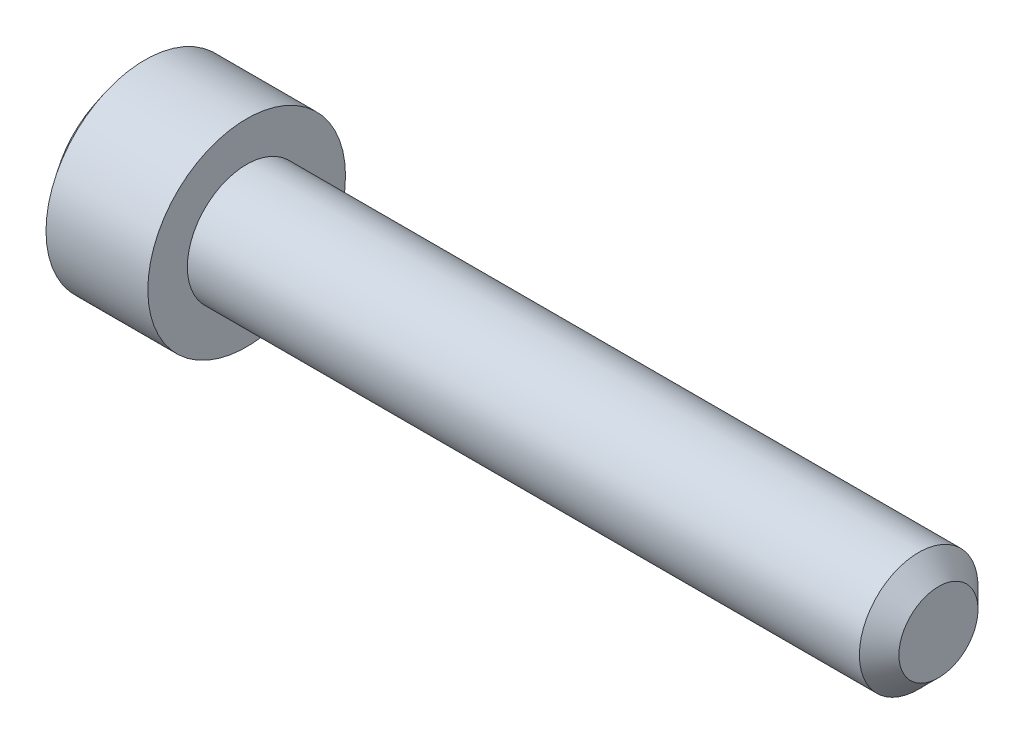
ISO-10303-21;
HEADER;
FILE_DESCRIPTION(('STEP AP214'),'2;1');
FILE_NAME('part.step','',(''),(''),'','','');
FILE_SCHEMA(('AUTOMOTIVE_DESIGN { 1 0 10303 214 1 1 1 1 }'));
ENDSEC;
DATA;
#1=APPLICATION_CONTEXT('core data for automotive mechanical design processes');
#2=APPLICATION_PROTOCOL_DEFINITION('international standard','automotive_design',2000,#1);
#3=PRODUCT_CONTEXT('',#1,'mechanical');
#4=PRODUCT('Part','Part','',(#3));
#5=PRODUCT_RELATED_PRODUCT_CATEGORY('part','',(#4));
#6=PRODUCT_DEFINITION_FORMATION('','',#4);
#7=PRODUCT_DEFINITION_CONTEXT('part definition',#1,'design');
#8=PRODUCT_DEFINITION('design','',#6,#7);
#9=PRODUCT_DEFINITION_SHAPE('','',#8);
#10=(LENGTH_UNIT() NAMED_UNIT(*) SI_UNIT(.MILLI.,.METRE.));
#11=(NAMED_UNIT(*) PLANE_ANGLE_UNIT() SI_UNIT($,.RADIAN.));
#12=(NAMED_UNIT(*) SI_UNIT($,.STERADIAN.) SOLID_ANGLE_UNIT());
#13=UNCERTAINTY_MEASURE_WITH_UNIT(LENGTH_MEASURE(1.E-05),#10,'distance_accuracy_value','');
#14=(GEOMETRIC_REPRESENTATION_CONTEXT(3) GLOBAL_UNCERTAINTY_ASSIGNED_CONTEXT((#13)) GLOBAL_UNIT_ASSIGNED_CONTEXT((#10,
#11,#12)) REPRESENTATION_CONTEXT('',''));
#15=CARTESIAN_POINT('',(0.,0.,0.));
#16=DIRECTION('',(0.,0.,1.));
#17=DIRECTION('',(1.,0.,0.));
#18=AXIS2_PLACEMENT_3D('',#15,#16,#17);
#19=CARTESIAN_POINT('',(0.,0.,0.));
#20=DIRECTION('',(-1.,0.,0.));
#21=DIRECTION('',(0.,0.,1.));
#22=AXIS2_PLACEMENT_3D('',#19,#20,#21);
#23=PLANE('',#22);
#24=CARTESIAN_POINT('',(0.,0.,0.));
#25=DIRECTION('',(-1.,0.,0.));
#26=DIRECTION('',(0.,0.,1.));
#27=AXIS2_PLACEMENT_3D('',#24,#25,#26);
#28=CIRCLE('',#27,3.86862915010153);
#29=CARTESIAN_POINT('',(0.,0.,3.86862915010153));
#30=VERTEX_POINT('',#29);
#31=EDGE_CURVE('E11',#30,#30,#28,.T.);
#32=ORIENTED_EDGE('',*,*,#31,.T.);
#33=EDGE_LOOP('',(#32));
#34=FACE_BOUND('',#33,.T.);
#35=DIRECTION('',(0.,0.909373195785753,-0.415981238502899));
#36=VECTOR('',#35,1.);
#37=CARTESIAN_POINT('',(0.,-2.19361678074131,-1.89600279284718));
#38=LINE('',#37,#36);
#39=CARTESIAN_POINT('',(0.,-2.19361678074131,-1.89600279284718));
#40=VERTEX_POINT('',#39);
#41=CARTESIAN_POINT('',(0.,0.,-2.89944497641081));
#42=VERTEX_POINT('',#41);
#43=EDGE_CURVE('E104',#40,#42,#38,.T.);
#44=ORIENTED_EDGE('',*,*,#43,.T.);
#45=DIRECTION('',(0.,0.862233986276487,0.506510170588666));
#46=VECTOR('',#45,1.);
#47=CARTESIAN_POINT('',(0.,0.,-2.89944497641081));
#48=LINE('',#47,#46);
#49=CARTESIAN_POINT('',(0.,2.5325508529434,-1.41172495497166));
#50=VERTEX_POINT('',#49);
#51=EDGE_CURVE('E45',#42,#50,#48,.T.);
#52=ORIENTED_EDGE('',*,*,#51,.T.);
#53=DIRECTION('',(0.,-0.101933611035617,0.994791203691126));
#54=VECTOR('',#53,1.);
#55=CARTESIAN_POINT('',(0.,2.5325508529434,-1.41172495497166));
#56=LINE('',#55,#54);
#57=CARTESIAN_POINT('',(0.,2.19361678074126,1.89600279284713));
#58=VERTEX_POINT('',#57);
#59=EDGE_CURVE('E85',#50,#58,#56,.T.);
#60=ORIENTED_EDGE('',*,*,#59,.T.);
#61=DIRECTION('',(0.,-0.909373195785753,0.415981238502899));
#62=VECTOR('',#61,1.);
#63=CARTESIAN_POINT('',(0.,2.19361678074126,1.89600279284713));
#64=LINE('',#63,#62);
#65=CARTESIAN_POINT('',(0.,0.,2.89944497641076));
#66=VERTEX_POINT('',#65);
#67=EDGE_CURVE('E93',#58,#66,#64,.T.);
#68=ORIENTED_EDGE('',*,*,#67,.T.);
#69=DIRECTION('',(0.,-0.862233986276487,-0.506510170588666));
#70=VECTOR('',#69,1.);
#71=CARTESIAN_POINT('',(0.,0.,2.89944497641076));
#72=LINE('',#71,#70);
#73=CARTESIAN_POINT('',(0.,-2.5325508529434,1.41172495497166));
#74=VERTEX_POINT('',#73);
#75=EDGE_CURVE('E108',#66,#74,#72,.T.);
#76=ORIENTED_EDGE('',*,*,#75,.T.);
#77=DIRECTION('',(0.,0.101933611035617,-0.994791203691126));
#78=VECTOR('',#77,1.);
#79=CARTESIAN_POINT('',(0.,-2.5325508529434,1.41172495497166));
#80=LINE('',#79,#78);
#81=EDGE_CURVE('E111',#74,#40,#80,.T.);
#82=ORIENTED_EDGE('',*,*,#81,.T.);
#83=EDGE_LOOP('',(#44,#52,#60,#68,#76,#82));
#84=FACE_BOUND('',#83,.T.);
#85=ADVANCED_FACE('F31',(#34,#84),#23,.T.);
#86=CARTESIAN_POINT('',(0.,0.,0.));
#87=DIRECTION('',(1.,0.,0.));
#88=DIRECTION('',(0.,0.,-1.));
#89=AXIS2_PLACEMENT_3D('',#86,#87,#88);
#90=CONICAL_SURFACE('',#89,3.86862915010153,0.927295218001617);
#91=CARTESIAN_POINT('',(0.848528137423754,0.,0.));
#92=DIRECTION('',(-1.,0.,0.));
#93=DIRECTION('',(0.,0.,1.));
#94=AXIS2_PLACEMENT_3D('',#91,#92,#93);
#95=CIRCLE('',#94,5.00000000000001);
#96=CARTESIAN_POINT('',(0.848528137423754,0.,5.00000000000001));
#97=VERTEX_POINT('',#96);
#98=EDGE_CURVE('E38',#97,#97,#95,.T.);
#99=ORIENTED_EDGE('',*,*,#98,.T.);
#100=EDGE_LOOP('',(#99));
#101=FACE_BOUND('',#100,.T.);
#102=ORIENTED_EDGE('',*,*,#31,.F.);
#103=EDGE_LOOP('',(#102));
#104=FACE_BOUND('',#103,.T.);
#105=ADVANCED_FACE('F146',(#101,#104),#90,.T.);
#106=CARTESIAN_POINT('',(-28.5761966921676,0.,0.));
#107=DIRECTION('',(-1.,0.,0.));
#108=DIRECTION('',(0.,0.,1.));
#109=AXIS2_PLACEMENT_3D('',#106,#107,#108);
#110=CYLINDRICAL_SURFACE('',#109,5.00000000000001);
#111=CARTESIAN_POINT('',(6.00000000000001,0.,0.));
#112=DIRECTION('',(-1.,0.,0.));
#113=DIRECTION('',(0.,0.,1.));
#114=AXIS2_PLACEMENT_3D('',#111,#112,#113);
#115=CIRCLE('',#114,5.00000000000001);
#116=CARTESIAN_POINT('',(6.00000000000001,0.,5.00000000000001));
#117=VERTEX_POINT('',#116);
#118=EDGE_CURVE('E141',#117,#117,#115,.T.);
#119=ORIENTED_EDGE('',*,*,#118,.T.);
#120=EDGE_LOOP('',(#119));
#121=FACE_BOUND('',#120,.T.);
#122=ORIENTED_EDGE('',*,*,#98,.F.);
#123=EDGE_LOOP('',(#122));
#124=FACE_BOUND('',#123,.T.);
#125=ADVANCED_FACE('F149',(#121,#124),#110,.T.);
#126=CARTESIAN_POINT('',(6.00000000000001,4.99999999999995,0.));
#127=DIRECTION('',(1.,0.,0.));
#128=DIRECTION('',(0.,0.,-1.));
#129=AXIS2_PLACEMENT_3D('',#126,#127,#128);
#130=PLANE('',#129);
#131=CARTESIAN_POINT('',(6.00000000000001,0.,0.));
#132=DIRECTION('',(-1.,0.,0.));
#133=DIRECTION('',(0.,0.,1.));
#134=AXIS2_PLACEMENT_3D('',#131,#132,#133);
#135=CIRCLE('',#134,2.99999999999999);
#136=CARTESIAN_POINT('',(6.00000000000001,0.,2.99999999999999));
#137=VERTEX_POINT('',#136);
#138=EDGE_CURVE('E138',#137,#137,#135,.T.);
#139=ORIENTED_EDGE('',*,*,#138,.T.);
#140=EDGE_LOOP('',(#139));
#141=FACE_BOUND('',#140,.T.);
#142=ORIENTED_EDGE('',*,*,#118,.F.);
#143=EDGE_LOOP('',(#142));
#144=FACE_BOUND('',#143,.T.);
#145=ADVANCED_FACE('F151',(#141,#144),#130,.T.);
#146=CARTESIAN_POINT('',(-28.5761966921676,0.,0.));
#147=DIRECTION('',(-1.,0.,0.));
#148=DIRECTION('',(0.,0.,1.));
#149=AXIS2_PLACEMENT_3D('',#146,#147,#148);
#150=CYLINDRICAL_SURFACE('',#149,2.99999999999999);
#151=CARTESIAN_POINT('',(40.,0.,0.));
#152=DIRECTION('',(-1.,0.,0.));
#153=DIRECTION('',(0.,0.,1.));
#154=AXIS2_PLACEMENT_3D('',#151,#152,#153);
#155=CIRCLE('',#154,2.99999999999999);
#156=CARTESIAN_POINT('',(40.,0.,2.99999999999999));
#157=VERTEX_POINT('',#156);
#158=EDGE_CURVE('E135',#157,#157,#155,.T.);
#159=ORIENTED_EDGE('',*,*,#158,.T.);
#160=EDGE_LOOP('',(#159));
#161=FACE_BOUND('',#160,.T.);
#162=ORIENTED_EDGE('',*,*,#138,.F.);
#163=EDGE_LOOP('',(#162));
#164=FACE_BOUND('',#163,.T.);
#165=ADVANCED_FACE('F158',(#161,#164),#150,.T.);
#166=CARTESIAN_POINT('',(40.,0.,0.));
#167=DIRECTION('',(-1.,0.,0.));
#168=DIRECTION('',(0.,0.,1.));
#169=AXIS2_PLACEMENT_3D('',#166,#167,#168);
#170=CONICAL_SURFACE('',#169,2.99999999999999,0.785398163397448);
#171=CARTESIAN_POINT('',(41.,0.,0.));
#172=DIRECTION('',(-1.,0.,0.));
#173=DIRECTION('',(0.,0.,1.));
#174=AXIS2_PLACEMENT_3D('',#171,#172,#173);
#175=CIRCLE('',#174,1.99999999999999);
#176=CARTESIAN_POINT('',(41.,0.,1.99999999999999));
#177=VERTEX_POINT('',#176);
#178=EDGE_CURVE('E99',#177,#177,#175,.T.);
#179=ORIENTED_EDGE('',*,*,#178,.T.);
#180=EDGE_LOOP('',(#179));
#181=FACE_BOUND('',#180,.T.);
#182=ORIENTED_EDGE('',*,*,#158,.F.);
#183=EDGE_LOOP('',(#182));
#184=FACE_BOUND('',#183,.T.);
#185=ADVANCED_FACE('F189',(#181,#184),#170,.T.);
#186=CARTESIAN_POINT('',(40.9999999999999,2.00000000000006,0.));
#187=DIRECTION('',(1.,0.,0.));
#188=DIRECTION('',(0.,0.,-1.));
#189=AXIS2_PLACEMENT_3D('',#186,#187,#188);
#190=PLANE('',#189);
#191=ORIENTED_EDGE('',*,*,#178,.F.);
#192=EDGE_LOOP('',(#191));
#193=FACE_BOUND('',#192,.T.);
#194=ADVANCED_FACE('F199',(#193),#190,.T.);
#195=CARTESIAN_POINT('',(3.00000000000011,0.,-2.89944497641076));
#196=DIRECTION('',(0.,-0.506510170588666,0.862233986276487));
#197=DIRECTION('',(0.,-0.862233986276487,-0.506510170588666));
#198=AXIS2_PLACEMENT_3D('',#195,#196,#197);
#199=PLANE('',#198);
#200=ORIENTED_EDGE('',*,*,#51,.F.);
#201=DIRECTION('',(-1.,0.,0.));
#202=VECTOR('',#201,1.);
#203=CARTESIAN_POINT('',(3.00000000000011,0.,-2.89944497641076));
#204=LINE('',#203,#202);
#205=CARTESIAN_POINT('',(3.00000000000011,0.,-2.89944497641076));
#206=VERTEX_POINT('',#205);
#207=EDGE_CURVE('E124',#206,#42,#204,.T.);
#208=ORIENTED_EDGE('',*,*,#207,.F.);
#209=DIRECTION('',(0.,0.862233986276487,0.506510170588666));
#210=VECTOR('',#209,1.);
#211=CARTESIAN_POINT('',(3.00000000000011,0.,-2.89944497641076));
#212=LINE('',#211,#210);
#213=CARTESIAN_POINT('',(3.,2.53255085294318,-1.41172495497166));
#214=VERTEX_POINT('',#213);
#215=EDGE_CURVE('E98',#206,#214,#212,.T.);
#216=ORIENTED_EDGE('',*,*,#215,.T.);
#217=DIRECTION('',(-1.,0.,0.));
#218=VECTOR('',#217,1.);
#219=CARTESIAN_POINT('',(3.,2.53255085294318,-1.41172495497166));
#220=LINE('',#219,#218);
#221=EDGE_CURVE('E87',#214,#50,#220,.T.);
#222=ORIENTED_EDGE('',*,*,#221,.T.);
#223=EDGE_LOOP('',(#200,#208,#216,#222));
#224=FACE_BOUND('',#223,.T.);
#225=ADVANCED_FACE('F96',(#224),#199,.T.);
#226=CARTESIAN_POINT('',(3.,2.53255085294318,-1.41172495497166));
#227=DIRECTION('',(0.,-0.994791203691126,-0.101933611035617));
#228=DIRECTION('',(0.,0.101933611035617,-0.994791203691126));
#229=AXIS2_PLACEMENT_3D('',#226,#227,#228);
#230=PLANE('',#229);
#231=ORIENTED_EDGE('',*,*,#59,.F.);
#232=ORIENTED_EDGE('',*,*,#221,.F.);
#233=DIRECTION('',(0.,-0.101933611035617,0.994791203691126));
#234=VECTOR('',#233,1.);
#235=CARTESIAN_POINT('',(3.,2.53255085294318,-1.41172495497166));
#236=LINE('',#235,#234);
#237=CARTESIAN_POINT('',(3.00000000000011,2.1936167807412,1.89600279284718));
#238=VERTEX_POINT('',#237);
#239=EDGE_CURVE('E115',#214,#238,#236,.T.);
#240=ORIENTED_EDGE('',*,*,#239,.T.);
#241=DIRECTION('',(-1.,0.,0.));
#242=VECTOR('',#241,1.);
#243=CARTESIAN_POINT('',(3.00000000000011,2.1936167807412,1.89600279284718));
#244=LINE('',#243,#242);
#245=EDGE_CURVE('E89',#238,#58,#244,.T.);
#246=ORIENTED_EDGE('',*,*,#245,.T.);
#247=EDGE_LOOP('',(#231,#232,#240,#246));
#248=FACE_BOUND('',#247,.T.);
#249=ADVANCED_FACE('F86',(#248),#230,.T.);
#250=CARTESIAN_POINT('',(3.00000000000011,2.1936167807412,1.89600279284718));
#251=DIRECTION('',(0.,-0.415981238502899,-0.909373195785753));
#252=DIRECTION('',(0.,0.909373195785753,-0.415981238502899));
#253=AXIS2_PLACEMENT_3D('',#250,#251,#252);
#254=PLANE('',#253);
#255=ORIENTED_EDGE('',*,*,#67,.F.);
#256=ORIENTED_EDGE('',*,*,#245,.F.);
#257=DIRECTION('',(0.,-0.909373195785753,0.415981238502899));
#258=VECTOR('',#257,1.);
#259=CARTESIAN_POINT('',(3.00000000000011,2.1936167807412,1.89600279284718));
#260=LINE('',#259,#258);
#261=CARTESIAN_POINT('',(3.,0.,2.89944497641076));
#262=VERTEX_POINT('',#261);
#263=EDGE_CURVE('E117',#238,#262,#260,.T.);
#264=ORIENTED_EDGE('',*,*,#263,.T.);
#265=DIRECTION('',(-1.,0.,0.));
#266=VECTOR('',#265,1.);
#267=CARTESIAN_POINT('',(3.,0.,2.89944497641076));
#268=LINE('',#267,#266);
#269=EDGE_CURVE('E130',#262,#66,#268,.T.);
#270=ORIENTED_EDGE('',*,*,#269,.T.);
#271=EDGE_LOOP('',(#255,#256,#264,#270));
#272=FACE_BOUND('',#271,.T.);
#273=ADVANCED_FACE('F226',(#272),#254,.T.);
#274=CARTESIAN_POINT('',(3.,0.,2.89944497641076));
#275=DIRECTION('',(0.,0.506510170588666,-0.862233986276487));
#276=DIRECTION('',(0.,0.862233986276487,0.506510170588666));
#277=AXIS2_PLACEMENT_3D('',#274,#275,#276);
#278=PLANE('',#277);
#279=ORIENTED_EDGE('',*,*,#75,.F.);
#280=ORIENTED_EDGE('',*,*,#269,.F.);
#281=DIRECTION('',(0.,-0.862233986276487,-0.506510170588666));
#282=VECTOR('',#281,1.);
#283=CARTESIAN_POINT('',(3.,0.,2.89944497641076));
#284=LINE('',#283,#282);
#285=CARTESIAN_POINT('',(3.,-2.5325508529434,1.41172495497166));
#286=VERTEX_POINT('',#285);
#287=EDGE_CURVE('E119',#262,#286,#284,.T.);
#288=ORIENTED_EDGE('',*,*,#287,.T.);
#289=DIRECTION('',(-1.,0.,0.));
#290=VECTOR('',#289,1.);
#291=CARTESIAN_POINT('',(3.,-2.5325508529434,1.41172495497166));
#292=LINE('',#291,#290);
#293=EDGE_CURVE('E128',#286,#74,#292,.T.);
#294=ORIENTED_EDGE('',*,*,#293,.T.);
#295=EDGE_LOOP('',(#279,#280,#288,#294));
#296=FACE_BOUND('',#295,.T.);
#297=ADVANCED_FACE('F235',(#296),#278,.T.);
#298=CARTESIAN_POINT('',(3.,-2.5325508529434,1.41172495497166));
#299=DIRECTION('',(0.,0.994791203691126,0.101933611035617));
#300=DIRECTION('',(0.,-0.101933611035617,0.994791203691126));
#301=AXIS2_PLACEMENT_3D('',#298,#299,#300);
#302=PLANE('',#301);
#303=ORIENTED_EDGE('',*,*,#81,.F.);
#304=ORIENTED_EDGE('',*,*,#293,.F.);
#305=DIRECTION('',(0.,0.101933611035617,-0.994791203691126));
#306=VECTOR('',#305,1.);
#307=CARTESIAN_POINT('',(3.,-2.5325508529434,1.41172495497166));
#308=LINE('',#307,#306);
#309=CARTESIAN_POINT('',(3.,-2.19361678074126,-1.89600279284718));
#310=VERTEX_POINT('',#309);
#311=EDGE_CURVE('E121',#286,#310,#308,.T.);
#312=ORIENTED_EDGE('',*,*,#311,.T.);
#313=DIRECTION('',(-1.,0.,0.));
#314=VECTOR('',#313,1.);
#315=CARTESIAN_POINT('',(3.,-2.19361678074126,-1.89600279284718));
#316=LINE('',#315,#314);
#317=EDGE_CURVE('E126',#310,#40,#316,.T.);
#318=ORIENTED_EDGE('',*,*,#317,.T.);
#319=EDGE_LOOP('',(#303,#304,#312,#318));
#320=FACE_BOUND('',#319,.T.);
#321=ADVANCED_FACE('F245',(#320),#302,.T.);
#322=CARTESIAN_POINT('',(3.,-2.19361678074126,-1.89600279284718));
#323=DIRECTION('',(0.,0.415981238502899,0.909373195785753));
#324=DIRECTION('',(0.,-0.909373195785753,0.415981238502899));
#325=AXIS2_PLACEMENT_3D('',#322,#323,#324);
#326=PLANE('',#325);
#327=ORIENTED_EDGE('',*,*,#43,.F.);
#328=ORIENTED_EDGE('',*,*,#317,.F.);
#329=DIRECTION('',(0.,0.909373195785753,-0.415981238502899));
#330=VECTOR('',#329,1.);
#331=CARTESIAN_POINT('',(3.,-2.19361678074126,-1.89600279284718));
#332=LINE('',#331,#330);
#333=EDGE_CURVE('E52',#310,#206,#332,.T.);
#334=ORIENTED_EDGE('',*,*,#333,.T.);
#335=ORIENTED_EDGE('',*,*,#207,.T.);
#336=EDGE_LOOP('',(#327,#328,#334,#335));
#337=FACE_BOUND('',#336,.T.);
#338=ADVANCED_FACE('F255',(#337),#326,.T.);
#339=CARTESIAN_POINT('',(3.,2.53255085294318,-1.41172495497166));
#340=DIRECTION('',(1.,0.,0.));
#341=DIRECTION('',(0.,0.,-1.));
#342=AXIS2_PLACEMENT_3D('',#339,#340,#341);
#343=PLANE('',#342);
#344=ORIENTED_EDGE('',*,*,#215,.F.);
#345=ORIENTED_EDGE('',*,*,#333,.F.);
#346=ORIENTED_EDGE('',*,*,#311,.F.);
#347=ORIENTED_EDGE('',*,*,#287,.F.);
#348=ORIENTED_EDGE('',*,*,#263,.F.);
#349=ORIENTED_EDGE('',*,*,#239,.F.);
#350=EDGE_LOOP('',(#344,#345,#346,#347,#348,#349));
#351=FACE_BOUND('',#350,.T.);
#352=ADVANCED_FACE('F265',(#351),#343,.F.);
#353=CLOSED_SHELL('',(#85,#105,#125,#145,#165,#185,#194,#225,#249,#273,#297,#321,#338,#352));
#354=MANIFOLD_SOLID_BREP('B2',#353);
#355=ADVANCED_BREP_SHAPE_REPRESENTATION('',(#18,#354),#14);
#356=SHAPE_DEFINITION_REPRESENTATION(#9,#355);
ENDSEC;
END-ISO-10303-21;
